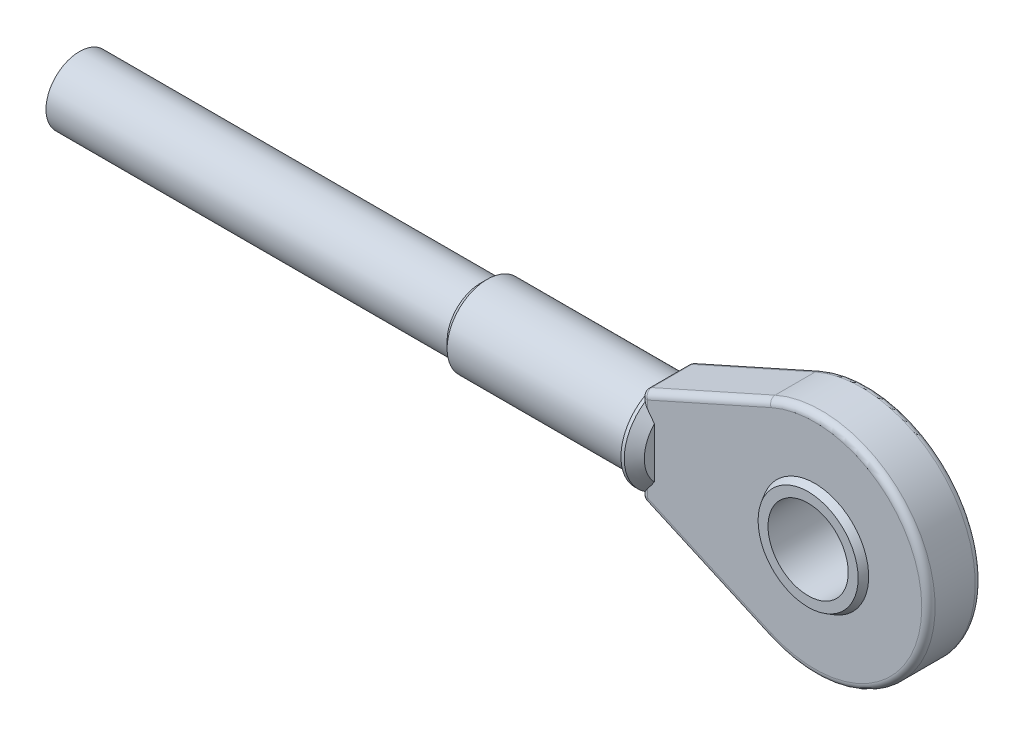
ISO-10303-21;
HEADER;
FILE_DESCRIPTION(('STEP AP214'),'2;1');
FILE_NAME('part.step','',(''),(''),'','','');
FILE_SCHEMA(('AUTOMOTIVE_DESIGN { 1 0 10303 214 1 1 1 1 }'));
ENDSEC;
DATA;
#1=APPLICATION_CONTEXT('core data for automotive mechanical design processes');
#2=APPLICATION_PROTOCOL_DEFINITION('international standard','automotive_design',2000,#1);
#3=PRODUCT_CONTEXT('',#1,'mechanical');
#4=PRODUCT('Part','Part','',(#3));
#5=PRODUCT_RELATED_PRODUCT_CATEGORY('part','',(#4));
#6=PRODUCT_DEFINITION_FORMATION('','',#4);
#7=PRODUCT_DEFINITION_CONTEXT('part definition',#1,'design');
#8=PRODUCT_DEFINITION('design','',#6,#7);
#9=PRODUCT_DEFINITION_SHAPE('','',#8);
#10=(LENGTH_UNIT() NAMED_UNIT(*) SI_UNIT(.MILLI.,.METRE.));
#11=(NAMED_UNIT(*) PLANE_ANGLE_UNIT() SI_UNIT($,.RADIAN.));
#12=(NAMED_UNIT(*) SI_UNIT($,.STERADIAN.) SOLID_ANGLE_UNIT());
#13=UNCERTAINTY_MEASURE_WITH_UNIT(LENGTH_MEASURE(1.E-05),#10,'distance_accuracy_value','');
#14=(GEOMETRIC_REPRESENTATION_CONTEXT(3) GLOBAL_UNCERTAINTY_ASSIGNED_CONTEXT((#13)) GLOBAL_UNIT_ASSIGNED_CONTEXT((#10,
#11,#12)) REPRESENTATION_CONTEXT('',''));
#15=CARTESIAN_POINT('',(0.,0.,0.));
#16=DIRECTION('',(0.,0.,1.));
#17=DIRECTION('',(1.,0.,0.));
#18=AXIS2_PLACEMENT_3D('',#15,#16,#17);
#19=CARTESIAN_POINT('',(54.,0.,0.));
#20=DIRECTION('',(-1.,0.,0.));
#21=DIRECTION('',(0.,1.,0.));
#22=AXIS2_PLACEMENT_3D('',#19,#20,#21);
#23=SPHERICAL_SURFACE('',#22,9.);
#24=CARTESIAN_POINT('',(54.,0.,0.));
#25=DIRECTION('',(0.,0.,-1.));
#26=DIRECTION('',(-1.,0.,0.));
#27=AXIS2_PLACEMENT_3D('',#24,#25,#26);
#28=SPHERICAL_SURFACE('',#27,9.);
#29=CARTESIAN_POINT('',(54.,0.,4.));
#30=DIRECTION('',(0.,0.,-1.));
#31=DIRECTION('',(-1.,0.,0.));
#32=AXIS2_PLACEMENT_3D('',#29,#30,#31);
#33=CIRCLE('',#32,8.06225774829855);
#34=CARTESIAN_POINT('',(45.9377422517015,0.,4.));
#35=VERTEX_POINT('',#34);
#36=EDGE_CURVE('E691',#35,#35,#33,.F.);
#37=ORIENTED_EDGE('',*,*,#36,.T.);
#38=EDGE_LOOP('',(#37));
#39=FACE_BOUND('',#38,.T.);
#40=CARTESIAN_POINT('',(54.,0.,5.));
#41=DIRECTION('',(0.,0.,1.));
#42=DIRECTION('',(1.,0.,0.));
#43=AXIS2_PLACEMENT_3D('',#40,#41,#42);
#44=CIRCLE('',#43,7.48331477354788);
#45=CARTESIAN_POINT('',(61.4833147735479,0.,5.));
#46=VERTEX_POINT('',#45);
#47=EDGE_CURVE('E516',#46,#46,#44,.T.);
#48=ORIENTED_EDGE('',*,*,#47,.F.);
#49=EDGE_LOOP('',(#48));
#50=FACE_BOUND('',#49,.T.);
#51=ADVANCED_FACE('F369',(#39,#50),#28,.T.);
#52=CARTESIAN_POINT('',(30.,0.,0.));
#53=DIRECTION('',(1.,0.,0.));
#54=DIRECTION('',(0.,0.,-1.));
#55=AXIS2_PLACEMENT_3D('',#52,#53,#54);
#56=PLANE('',#55);
#57=DIRECTION('',(0.,1.,0.));
#58=VECTOR('',#57,1.);
#59=CARTESIAN_POINT('',(30.,-4.,-4.));
#60=LINE('',#59,#58);
#61=CARTESIAN_POINT('',(30.,-3.77491721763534,-4.));
#62=VERTEX_POINT('',#61);
#63=CARTESIAN_POINT('',(30.,3.77491721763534,-4.));
#64=VERTEX_POINT('',#63);
#65=EDGE_CURVE('E500',#62,#64,#60,.T.);
#66=ORIENTED_EDGE('',*,*,#65,.F.);
#67=CARTESIAN_POINT('',(30.,0.,0.));
#68=DIRECTION('',(1.,0.,0.));
#69=DIRECTION('',(0.,0.,-1.));
#70=AXIS2_PLACEMENT_3D('',#67,#68,#69);
#71=CIRCLE('',#70,5.49999999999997);
#72=EDGE_CURVE('E511',#62,#64,#71,.T.);
#73=ORIENTED_EDGE('',*,*,#72,.T.);
#74=EDGE_LOOP('',(#66,#73));
#75=FACE_BOUND('',#74,.T.);
#76=ADVANCED_FACE('F510',(#75),#56,.T.);
#77=CARTESIAN_POINT('',(30.,0.,0.));
#78=DIRECTION('',(-1.,0.,0.));
#79=DIRECTION('',(0.,0.,1.));
#80=AXIS2_PLACEMENT_3D('',#77,#78,#79);
#81=CYLINDRICAL_SURFACE('',#80,7.);
#82=CARTESIAN_POINT('',(28.,0.,0.));
#83=DIRECTION('',(1.,0.,0.));
#84=DIRECTION('',(0.,0.,-1.));
#85=AXIS2_PLACEMENT_3D('',#82,#83,#84);
#86=CIRCLE('',#85,7.);
#87=CARTESIAN_POINT('',(28.,-6.32455532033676,-3.));
#88=VERTEX_POINT('',#87);
#89=CARTESIAN_POINT('',(28.,6.32455532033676,-3.));
#90=VERTEX_POINT('',#89);
#91=EDGE_CURVE('E512',#88,#90,#86,.T.);
#92=ORIENTED_EDGE('',*,*,#91,.T.);
#93=CARTESIAN_POINT('',(28.,6.32455532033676,-3.));
#94=CARTESIAN_POINT('',(27.9999990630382,6.29460979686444,-3.06322005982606));
#95=CARTESIAN_POINT('',(28.0059913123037,6.26367381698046,-3.12590551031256));
#96=CARTESIAN_POINT('',(28.029427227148,6.20079028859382,-3.24882066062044));
#97=CARTESIAN_POINT('',(28.0469047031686,6.16884001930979,-3.30904255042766));
#98=CARTESIAN_POINT('',(28.0927628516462,6.10509614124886,-3.42523477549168));
#99=CARTESIAN_POINT('',(28.1211403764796,6.07330248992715,-3.48120633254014));
#100=CARTESIAN_POINT('',(28.1882266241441,6.01122724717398,-3.58732541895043));
#101=CARTESIAN_POINT('',(28.2269083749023,5.98094194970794,-3.63748766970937));
#102=CARTESIAN_POINT('',(28.3033345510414,5.93049185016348,-3.71900087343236));
#103=CARTESIAN_POINT('',(28.3389578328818,5.90967302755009,-3.7519402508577));
#104=CARTESIAN_POINT('',(28.4155526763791,5.87052402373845,-3.81290988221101));
#105=CARTESIAN_POINT('',(28.4565378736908,5.8522004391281,-3.84092717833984));
#106=CARTESIAN_POINT('',(28.5,5.83556745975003,-3.86602540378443));
#107=B_SPLINE_CURVE_WITH_KNOTS('',3,(#93,#94,#95,#96,#97,#98,#99,#100,#101,#102,#103,#104,#105,
#106),.UNSPECIFIED.,.F.,.F.,(4,2,2,2,2,2,4),(0.,0.209520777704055,0.419661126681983,
0.629740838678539,0.839275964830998,0.997139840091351,1.15541327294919),.UNSPECIFIED.);
#108=CARTESIAN_POINT('',(28.5,5.83556745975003,-3.86602540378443));
#109=VERTEX_POINT('',#108);
#110=EDGE_CURVE('E603',#90,#109,#107,.T.);
#111=ORIENTED_EDGE('',*,*,#110,.T.);
#112=CARTESIAN_POINT('',(28.5,0.,0.));
#113=DIRECTION('',(1.,0.,0.));
#114=DIRECTION('',(0.,0.,-1.));
#115=AXIS2_PLACEMENT_3D('',#112,#113,#114);
#116=CIRCLE('',#115,7.);
#117=CARTESIAN_POINT('',(28.5,-5.83556745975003,-3.86602540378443));
#118=VERTEX_POINT('',#117);
#119=EDGE_CURVE('E392',#109,#118,#116,.F.);
#120=ORIENTED_EDGE('',*,*,#119,.T.);
#121=CARTESIAN_POINT('',(28.5,-5.83556745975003,-3.86602540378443));
#122=CARTESIAN_POINT('',(28.4478275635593,-5.85554295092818,-3.83589637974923));
#123=CARTESIAN_POINT('',(28.3992398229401,-5.87793426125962,-3.80157259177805));
#124=CARTESIAN_POINT('',(28.3099637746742,-5.92604152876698,-3.72612002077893));
#125=CARTESIAN_POINT('',(28.2692416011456,-5.95174240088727,-3.68502189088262));
#126=CARTESIAN_POINT('',(28.196084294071,-6.0050702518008,-3.59746608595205));
#127=CARTESIAN_POINT('',(28.1636210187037,-6.03269027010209,-3.5510274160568));
#128=CARTESIAN_POINT('',(28.1070833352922,-6.08891769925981,-3.45372955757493));
#129=CARTESIAN_POINT('',(28.0830226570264,-6.11752664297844,-3.40286330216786));
#130=CARTESIAN_POINT('',(28.0425669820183,-6.17648142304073,-3.29470150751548));
#131=CARTESIAN_POINT('',(28.0267134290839,-6.20682929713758,-3.23720349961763));
#132=CARTESIAN_POINT('',(28.0054364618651,-6.26660121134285,-3.11996025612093));
#133=CARTESIAN_POINT('',(27.9999981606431,-6.29602651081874,-3.06021835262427));
#134=CARTESIAN_POINT('',(28.,-6.32455532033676,-3.));
#135=B_SPLINE_CURVE_WITH_KNOTS('',3,(#121,#122,#123,#124,#125,#126,#127,#128,#129,#130,#131,
#132,#133,#134),.UNSPECIFIED.,.F.,.F.,(4,2,2,2,2,2,4),(0.,0.189856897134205,0.378877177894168,
0.567244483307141,0.755918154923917,0.95582068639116,1.15543727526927),.UNSPECIFIED.);
#136=EDGE_CURVE('E561',#118,#88,#135,.T.);
#137=ORIENTED_EDGE('',*,*,#136,.T.);
#138=EDGE_LOOP('',(#92,#111,#120,#137));
#139=FACE_BOUND('',#138,.T.);
#140=ADVANCED_FACE('F672',(#139),#81,.T.);
#141=CARTESIAN_POINT('',(54.,0.,0.));
#142=DIRECTION('',(0.,0.,1.));
#143=DIRECTION('',(1.,0.,0.));
#144=AXIS2_PLACEMENT_3D('',#141,#142,#143);
#145=SPHERICAL_SURFACE('',#144,9.);
#146=CARTESIAN_POINT('',(54.,0.,-5.));
#147=DIRECTION('',(0.,0.,1.));
#148=DIRECTION('',(1.,0.,0.));
#149=AXIS2_PLACEMENT_3D('',#146,#147,#148);
#150=CIRCLE('',#149,7.48331477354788);
#151=CARTESIAN_POINT('',(61.4833147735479,0.,-5.));
#152=VERTEX_POINT('',#151);
#153=EDGE_CURVE('E521',#152,#152,#150,.T.);
#154=ORIENTED_EDGE('',*,*,#153,.T.);
#155=EDGE_LOOP('',(#154));
#156=FACE_BOUND('',#155,.T.);
#157=CARTESIAN_POINT('',(54.,0.,-4.));
#158=DIRECTION('',(0.,0.,1.));
#159=DIRECTION('',(1.,0.,0.));
#160=AXIS2_PLACEMENT_3D('',#157,#158,#159);
#161=CIRCLE('',#160,8.06225774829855);
#162=CARTESIAN_POINT('',(62.0622577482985,0.,-4.));
#163=VERTEX_POINT('',#162);
#164=EDGE_CURVE('E690',#163,#163,#161,.F.);
#165=ORIENTED_EDGE('',*,*,#164,.T.);
#166=EDGE_LOOP('',(#165));
#167=FACE_BOUND('',#166,.T.);
#168=ADVANCED_FACE('F667',(#156,#167),#145,.T.);
#169=CARTESIAN_POINT('',(54.,4.,4.));
#170=DIRECTION('',(0.,0.,-1.));
#171=DIRECTION('',(-1.,0.,0.));
#172=AXIS2_PLACEMENT_3D('',#169,#170,#171);
#173=PLANE('',#172);
#174=CARTESIAN_POINT('',(30.,-3.77491721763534,4.));
#175=CARTESIAN_POINT('',(29.9415821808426,-3.86002294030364,4.));
#176=CARTESIAN_POINT('',(29.8824642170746,-3.94464346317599,4.));
#177=CARTESIAN_POINT('',(29.7629928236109,-4.11300171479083,4.));
#178=CARTESIAN_POINT('',(29.7026394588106,-4.19673948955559,4.));
#179=CARTESIAN_POINT('',(29.5200183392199,-4.44669923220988,4.));
#180=CARTESIAN_POINT('',(29.3961373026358,-4.61174316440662,4.));
#181=CARTESIAN_POINT('',(29.1450745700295,-4.93924639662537,4.));
#182=CARTESIAN_POINT('',(29.0178933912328,-5.1017060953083,4.));
#183=CARTESIAN_POINT('',(28.760810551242,-5.42457859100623,4.));
#184=CARTESIAN_POINT('',(28.6309077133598,-5.58499045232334,4.));
#185=CARTESIAN_POINT('',(28.5,-5.74456264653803,4.));
#186=B_SPLINE_CURVE_WITH_KNOTS('',3,(#174,#175,#176,#177,#178,#179,#180,#181,#182,#183,#184,
#185),.UNSPECIFIED.,.F.,.F.,(4,2,2,2,2,4),(0.,0.309668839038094,0.61932145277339,
1.23835119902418,1.85728450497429,2.47649116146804),.UNSPECIFIED.);
#187=CARTESIAN_POINT('',(30.,-3.77491721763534,4.));
#188=VERTEX_POINT('',#187);
#189=CARTESIAN_POINT('',(29.,-5.12347538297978,4.));
#190=VERTEX_POINT('',#189);
#191=EDGE_CURVE('E505',#188,#190,#186,.T.);
#192=ORIENTED_EDGE('',*,*,#191,.T.);
#193=DIRECTION('',(0.,-1.,0.));
#194=VECTOR('',#193,1.);
#195=CARTESIAN_POINT('',(29.,4.,4.));
#196=LINE('',#195,#194);
#197=CARTESIAN_POINT('',(29.,-6.35161365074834,4.));
#198=VERTEX_POINT('',#197);
#199=EDGE_CURVE('E752',#190,#198,#196,.T.);
#200=ORIENTED_EDGE('',*,*,#199,.T.);
#201=DIRECTION('',(0.91295991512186,-0.408049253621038,0.));
#202=VECTOR('',#201,1.);
#203=CARTESIAN_POINT('',(45.9810814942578,-13.941341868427,4.));
#204=LINE('',#203,#202);
#205=CARTESIAN_POINT('',(47.4712119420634,-14.6073586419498,4.));
#206=VERTEX_POINT('',#205);
#207=EDGE_CURVE('E750',#198,#206,#204,.T.);
#208=ORIENTED_EDGE('',*,*,#207,.T.);
#209=CARTESIAN_POINT('',(54.,0.,4.));
#210=DIRECTION('',(0.,0.,-1.));
#211=DIRECTION('',(-1.,0.,0.));
#212=AXIS2_PLACEMENT_3D('',#209,#210,#211);
#213=CIRCLE('',#212,16.);
#214=CARTESIAN_POINT('',(47.4712119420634,14.6073586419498,4.));
#215=VERTEX_POINT('',#214);
#216=EDGE_CURVE('E748',#206,#215,#213,.F.);
#217=ORIENTED_EDGE('',*,*,#216,.T.);
#218=DIRECTION('',(-0.91295991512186,-0.408049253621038,0.));
#219=VECTOR('',#218,1.);
#220=CARTESIAN_POINT('',(48.961342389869,15.2733754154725,4.));
#221=LINE('',#220,#219);
#222=CARTESIAN_POINT('',(29.,6.35161365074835,4.));
#223=VERTEX_POINT('',#222);
#224=EDGE_CURVE('E746',#215,#223,#221,.T.);
#225=ORIENTED_EDGE('',*,*,#224,.T.);
#226=DIRECTION('',(0.,-1.,0.));
#227=VECTOR('',#226,1.);
#228=CARTESIAN_POINT('',(29.,4.,4.));
#229=LINE('',#228,#227);
#230=CARTESIAN_POINT('',(28.9999999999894,5.12347538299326,4.));
#231=VERTEX_POINT('',#230);
#232=EDGE_CURVE('E744',#223,#231,#229,.T.);
#233=ORIENTED_EDGE('',*,*,#232,.T.);
#234=CARTESIAN_POINT('',(28.5,5.74456264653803,4.));
#235=CARTESIAN_POINT('',(28.6309077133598,5.58499045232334,4.));
#236=CARTESIAN_POINT('',(28.760810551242,5.42457859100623,4.));
#237=CARTESIAN_POINT('',(29.0178933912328,5.1017060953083,4.));
#238=CARTESIAN_POINT('',(29.1450745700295,4.93924639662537,4.));
#239=CARTESIAN_POINT('',(29.3961373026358,4.61174316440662,4.));
#240=CARTESIAN_POINT('',(29.5200183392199,4.44669923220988,4.));
#241=CARTESIAN_POINT('',(29.7026394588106,4.19673948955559,4.));
#242=CARTESIAN_POINT('',(29.7629928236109,4.11300171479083,4.));
#243=CARTESIAN_POINT('',(29.8824642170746,3.94464346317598,4.));
#244=CARTESIAN_POINT('',(29.9415821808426,3.86002294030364,4.));
#245=CARTESIAN_POINT('',(30.,3.77491721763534,4.));
#246=B_SPLINE_CURVE_WITH_KNOTS('',3,(#234,#235,#236,#237,#238,#239,#240,#241,#242,#243,#244,
#245),.UNSPECIFIED.,.F.,.F.,(4,2,2,2,2,4),(0.,0.619206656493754,1.23813996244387,
1.85716970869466,2.16682232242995,2.47649116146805),.UNSPECIFIED.);
#247=CARTESIAN_POINT('',(30.,3.77491721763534,4.));
#248=VERTEX_POINT('',#247);
#249=EDGE_CURVE('E833',#231,#248,#246,.T.);
#250=ORIENTED_EDGE('',*,*,#249,.T.);
#251=DIRECTION('',(0.,-1.,0.));
#252=VECTOR('',#251,1.);
#253=CARTESIAN_POINT('',(30.,4.,4.));
#254=LINE('',#253,#252);
#255=EDGE_CURVE('E513',#248,#188,#254,.T.);
#256=ORIENTED_EDGE('',*,*,#255,.T.);
#257=EDGE_LOOP('',(#192,#200,#208,#217,#225,#233,#250,#256));
#258=FACE_BOUND('',#257,.T.);
#259=ORIENTED_EDGE('',*,*,#36,.F.);
#260=EDGE_LOOP('',(#259));
#261=FACE_BOUND('',#260,.T.);
#262=ADVANCED_FACE('F677',(#258,#261),#173,.F.);
#263=CARTESIAN_POINT('',(54.,-4.,-4.));
#264=DIRECTION('',(0.,0.,1.));
#265=DIRECTION('',(1.,0.,0.));
#266=AXIS2_PLACEMENT_3D('',#263,#264,#265);
#267=PLANE('',#266);
#268=DIRECTION('',(0.91295991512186,-0.408049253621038,0.));
#269=VECTOR('',#268,1.);
#270=CARTESIAN_POINT('',(48.961342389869,-15.2733754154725,-4.));
#271=LINE('',#270,#269);
#272=CARTESIAN_POINT('',(47.4712119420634,-14.6073586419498,-4.));
#273=VERTEX_POINT('',#272);
#274=CARTESIAN_POINT('',(29.,-6.35161365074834,-4.));
#275=VERTEX_POINT('',#274);
#276=EDGE_CURVE('E741',#273,#275,#271,.F.);
#277=ORIENTED_EDGE('',*,*,#276,.T.);
#278=DIRECTION('',(0.,-1.,0.));
#279=VECTOR('',#278,1.);
#280=CARTESIAN_POINT('',(29.,-4.,-4.));
#281=LINE('',#280,#279);
#282=CARTESIAN_POINT('',(28.9999999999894,-5.12347538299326,-4.));
#283=VERTEX_POINT('',#282);
#284=EDGE_CURVE('E502',#275,#283,#281,.F.);
#285=ORIENTED_EDGE('',*,*,#284,.T.);
#286=CARTESIAN_POINT('',(28.5,-5.74456264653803,-4.));
#287=CARTESIAN_POINT('',(28.6309077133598,-5.58499045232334,-4.));
#288=CARTESIAN_POINT('',(28.760810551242,-5.42457859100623,-4.));
#289=CARTESIAN_POINT('',(29.0178933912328,-5.1017060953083,-4.));
#290=CARTESIAN_POINT('',(29.1450745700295,-4.93924639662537,-4.));
#291=CARTESIAN_POINT('',(29.3961373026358,-4.61174316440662,-4.));
#292=CARTESIAN_POINT('',(29.5200183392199,-4.44669923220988,-4.));
#293=CARTESIAN_POINT('',(29.7026394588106,-4.19673948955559,-4.));
#294=CARTESIAN_POINT('',(29.7629928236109,-4.11300171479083,-4.));
#295=CARTESIAN_POINT('',(29.8824642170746,-3.94464346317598,-4.));
#296=CARTESIAN_POINT('',(29.9415821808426,-3.86002294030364,-4.));
#297=CARTESIAN_POINT('',(30.,-3.77491721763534,-4.));
#298=B_SPLINE_CURVE_WITH_KNOTS('',3,(#286,#287,#288,#289,#290,#291,#292,#293,#294,#295,#296,
#297),.UNSPECIFIED.,.F.,.F.,(4,2,2,2,2,4),(0.,0.619206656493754,1.23813996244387,
1.85716970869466,2.16682232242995,2.47649116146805),.UNSPECIFIED.);
#299=EDGE_CURVE('E495',#283,#62,#298,.T.);
#300=ORIENTED_EDGE('',*,*,#299,.T.);
#301=ORIENTED_EDGE('',*,*,#65,.T.);
#302=CARTESIAN_POINT('',(30.,3.77491721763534,-4.));
#303=CARTESIAN_POINT('',(29.9415821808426,3.86002294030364,-4.));
#304=CARTESIAN_POINT('',(29.8824642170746,3.94464346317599,-4.));
#305=CARTESIAN_POINT('',(29.7629928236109,4.11300171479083,-4.));
#306=CARTESIAN_POINT('',(29.7026394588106,4.19673948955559,-4.));
#307=CARTESIAN_POINT('',(29.5200183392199,4.44669923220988,-4.));
#308=CARTESIAN_POINT('',(29.3961373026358,4.61174316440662,-4.));
#309=CARTESIAN_POINT('',(29.1450745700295,4.93924639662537,-4.));
#310=CARTESIAN_POINT('',(29.0178933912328,5.1017060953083,-4.));
#311=CARTESIAN_POINT('',(28.760810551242,5.42457859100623,-4.));
#312=CARTESIAN_POINT('',(28.6309077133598,5.58499045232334,-4.));
#313=CARTESIAN_POINT('',(28.5,5.74456264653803,-4.));
#314=B_SPLINE_CURVE_WITH_KNOTS('',3,(#302,#303,#304,#305,#306,#307,#308,#309,#310,#311,#312,
#313),.UNSPECIFIED.,.F.,.F.,(4,2,2,2,2,4),(0.,0.309668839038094,0.61932145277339,
1.23835119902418,1.85728450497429,2.47649116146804),.UNSPECIFIED.);
#315=CARTESIAN_POINT('',(29.,5.12347538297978,-4.));
#316=VERTEX_POINT('',#315);
#317=EDGE_CURVE('E506',#64,#316,#314,.T.);
#318=ORIENTED_EDGE('',*,*,#317,.T.);
#319=DIRECTION('',(0.,-1.,0.));
#320=VECTOR('',#319,1.);
#321=CARTESIAN_POINT('',(29.,-4.,-4.));
#322=LINE('',#321,#320);
#323=CARTESIAN_POINT('',(29.,6.35161365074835,-4.));
#324=VERTEX_POINT('',#323);
#325=EDGE_CURVE('E739',#316,#324,#322,.F.);
#326=ORIENTED_EDGE('',*,*,#325,.T.);
#327=DIRECTION('',(-0.91295991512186,-0.408049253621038,0.));
#328=VECTOR('',#327,1.);
#329=CARTESIAN_POINT('',(45.9810814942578,13.941341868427,-4.));
#330=LINE('',#329,#328);
#331=CARTESIAN_POINT('',(47.4712119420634,14.6073586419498,-4.));
#332=VERTEX_POINT('',#331);
#333=EDGE_CURVE('E734',#324,#332,#330,.F.);
#334=ORIENTED_EDGE('',*,*,#333,.T.);
#335=CARTESIAN_POINT('',(54.,0.,-4.));
#336=DIRECTION('',(0.,0.,1.));
#337=DIRECTION('',(1.,0.,0.));
#338=AXIS2_PLACEMENT_3D('',#335,#336,#337);
#339=CIRCLE('',#338,16.);
#340=EDGE_CURVE('E732',#332,#273,#339,.F.);
#341=ORIENTED_EDGE('',*,*,#340,.T.);
#342=EDGE_LOOP('',(#277,#285,#300,#301,#318,#326,#334,#341));
#343=FACE_BOUND('',#342,.T.);
#344=ORIENTED_EDGE('',*,*,#164,.F.);
#345=EDGE_LOOP('',(#344));
#346=FACE_BOUND('',#345,.T.);
#347=ADVANCED_FACE('F497',(#343,#346),#267,.F.);
#348=ORIENTED_EDGE('',*,*,#255,.F.);
#349=CARTESIAN_POINT('',(30.,0.,0.));
#350=DIRECTION('',(1.,0.,0.));
#351=DIRECTION('',(0.,0.,-1.));
#352=AXIS2_PLACEMENT_3D('',#349,#350,#351);
#353=CIRCLE('',#352,5.49999999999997);
#354=EDGE_CURVE('E518',#248,#188,#353,.T.);
#355=ORIENTED_EDGE('',*,*,#354,.T.);
#356=EDGE_LOOP('',(#348,#355));
#357=FACE_BOUND('',#356,.T.);
#358=ADVANCED_FACE('F673',(#357),#56,.T.);
#359=CARTESIAN_POINT('',(28.,0.,0.));
#360=DIRECTION('',(-1.,0.,0.));
#361=DIRECTION('',(0.,0.,1.));
#362=AXIS2_PLACEMENT_3D('',#359,#360,#361);
#363=CYLINDRICAL_SURFACE('',#362,6.);
#364=CARTESIAN_POINT('',(1.00000000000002,0.,0.));
#365=DIRECTION('',(1.,0.,0.));
#366=DIRECTION('',(0.,0.,-1.));
#367=AXIS2_PLACEMENT_3D('',#364,#365,#366);
#368=CIRCLE('',#367,6.);
#369=CARTESIAN_POINT('',(1.00000000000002,0.,-6.));
#370=VERTEX_POINT('',#369);
#371=EDGE_CURVE('E377',#370,#370,#368,.T.);
#372=ORIENTED_EDGE('',*,*,#371,.T.);
#373=EDGE_LOOP('',(#372));
#374=FACE_BOUND('',#373,.T.);
#375=CARTESIAN_POINT('',(28.,0.,0.));
#376=DIRECTION('',(1.,0.,0.));
#377=DIRECTION('',(0.,0.,-1.));
#378=AXIS2_PLACEMENT_3D('',#375,#376,#377);
#379=CIRCLE('',#378,6.);
#380=CARTESIAN_POINT('',(28.,0.,-6.));
#381=VERTEX_POINT('',#380);
#382=EDGE_CURVE('E704',#381,#381,#379,.T.);
#383=ORIENTED_EDGE('',*,*,#382,.F.);
#384=EDGE_LOOP('',(#383));
#385=FACE_BOUND('',#384,.T.);
#386=ADVANCED_FACE('F371',(#374,#385),#363,.T.);
#387=CARTESIAN_POINT('',(28.,0.,0.));
#388=DIRECTION('',(1.,0.,0.));
#389=DIRECTION('',(0.,0.,-1.));
#390=AXIS2_PLACEMENT_3D('',#387,#388,#389);
#391=PLANE('',#390);
#392=ORIENTED_EDGE('',*,*,#382,.T.);
#393=EDGE_LOOP('',(#392));
#394=FACE_BOUND('',#393,.T.);
#395=ORIENTED_EDGE('',*,*,#91,.F.);
#396=DIRECTION('',(0.,-1.,0.));
#397=VECTOR('',#396,1.);
#398=CARTESIAN_POINT('',(28.,0.,-3.));
#399=LINE('',#398,#397);
#400=CARTESIAN_POINT('',(28.,-6.35161365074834,-3.));
#401=VERTEX_POINT('',#400);
#402=EDGE_CURVE('E729',#88,#401,#399,.T.);
#403=ORIENTED_EDGE('',*,*,#402,.T.);
#404=DIRECTION('',(0.,0.,-1.));
#405=VECTOR('',#404,1.);
#406=CARTESIAN_POINT('',(28.,-6.35161365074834,0.));
#407=LINE('',#406,#405);
#408=CARTESIAN_POINT('',(28.,-6.35161365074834,3.));
#409=VERTEX_POINT('',#408);
#410=EDGE_CURVE('E719',#401,#409,#407,.F.);
#411=ORIENTED_EDGE('',*,*,#410,.T.);
#412=DIRECTION('',(0.,-1.,0.));
#413=VECTOR('',#412,1.);
#414=CARTESIAN_POINT('',(28.,0.,3.));
#415=LINE('',#414,#413);
#416=CARTESIAN_POINT('',(28.,-6.32455532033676,3.));
#417=VERTEX_POINT('',#416);
#418=EDGE_CURVE('E716',#409,#417,#415,.F.);
#419=ORIENTED_EDGE('',*,*,#418,.T.);
#420=CARTESIAN_POINT('',(28.,6.32455532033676,3.));
#421=VERTEX_POINT('',#420);
#422=EDGE_CURVE('E703',#421,#417,#86,.T.);
#423=ORIENTED_EDGE('',*,*,#422,.F.);
#424=DIRECTION('',(0.,-1.,0.));
#425=VECTOR('',#424,1.);
#426=CARTESIAN_POINT('',(28.,0.,3.));
#427=LINE('',#426,#425);
#428=CARTESIAN_POINT('',(28.,6.35161365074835,3.));
#429=VERTEX_POINT('',#428);
#430=EDGE_CURVE('E843',#421,#429,#427,.F.);
#431=ORIENTED_EDGE('',*,*,#430,.T.);
#432=DIRECTION('',(0.,0.,-1.));
#433=VECTOR('',#432,1.);
#434=CARTESIAN_POINT('',(28.,6.35161365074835,0.));
#435=LINE('',#434,#433);
#436=CARTESIAN_POINT('',(28.,6.35161365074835,-3.));
#437=VERTEX_POINT('',#436);
#438=EDGE_CURVE('E845',#429,#437,#435,.T.);
#439=ORIENTED_EDGE('',*,*,#438,.T.);
#440=DIRECTION('',(0.,-1.,0.));
#441=VECTOR('',#440,1.);
#442=CARTESIAN_POINT('',(28.,0.,-3.));
#443=LINE('',#442,#441);
#444=EDGE_CURVE('E721',#437,#90,#443,.T.);
#445=ORIENTED_EDGE('',*,*,#444,.T.);
#446=EDGE_LOOP('',(#395,#403,#411,#419,#423,#431,#439,#445));
#447=FACE_BOUND('',#446,.T.);
#448=ADVANCED_FACE('F717',(#394,#447),#391,.F.);
#449=ORIENTED_EDGE('',*,*,#422,.T.);
#450=CARTESIAN_POINT('',(28.,-6.32455532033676,3.));
#451=CARTESIAN_POINT('',(27.9999990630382,-6.29460979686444,3.06322005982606));
#452=CARTESIAN_POINT('',(28.0059913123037,-6.26367381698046,3.12590551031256));
#453=CARTESIAN_POINT('',(28.029427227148,-6.20079028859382,3.24882066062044));
#454=CARTESIAN_POINT('',(28.0469047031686,-6.16884001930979,3.30904255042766));
#455=CARTESIAN_POINT('',(28.0927628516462,-6.10509614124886,3.42523477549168));
#456=CARTESIAN_POINT('',(28.1211403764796,-6.07330248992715,3.48120633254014));
#457=CARTESIAN_POINT('',(28.1882266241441,-6.01122724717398,3.58732541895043));
#458=CARTESIAN_POINT('',(28.2269083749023,-5.98094194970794,3.63748766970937));
#459=CARTESIAN_POINT('',(28.3033345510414,-5.93049185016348,3.71900087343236));
#460=CARTESIAN_POINT('',(28.3389578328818,-5.90967302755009,3.7519402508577));
#461=CARTESIAN_POINT('',(28.4155526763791,-5.87052402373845,3.81290988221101));
#462=CARTESIAN_POINT('',(28.4565378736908,-5.8522004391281,3.84092717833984));
#463=CARTESIAN_POINT('',(28.5,-5.83556745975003,3.86602540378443));
#464=B_SPLINE_CURVE_WITH_KNOTS('',3,(#450,#451,#452,#453,#454,#455,#456,#457,#458,#459,#460,
#461,#462,#463),.UNSPECIFIED.,.F.,.F.,(4,2,2,2,2,2,4),(0.,0.209520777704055,0.419661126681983,
0.629740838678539,0.839275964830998,0.997139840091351,1.15541327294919),.UNSPECIFIED.);
#465=CARTESIAN_POINT('',(28.5,-5.83556745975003,3.86602540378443));
#466=VERTEX_POINT('',#465);
#467=EDGE_CURVE('E593',#417,#466,#464,.T.);
#468=ORIENTED_EDGE('',*,*,#467,.T.);
#469=CARTESIAN_POINT('',(28.5,0.,0.));
#470=DIRECTION('',(1.,0.,0.));
#471=DIRECTION('',(0.,0.,-1.));
#472=AXIS2_PLACEMENT_3D('',#469,#470,#471);
#473=CIRCLE('',#472,7.);
#474=CARTESIAN_POINT('',(28.5,5.83556745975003,3.86602540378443));
#475=VERTEX_POINT('',#474);
#476=EDGE_CURVE('E384',#466,#475,#473,.F.);
#477=ORIENTED_EDGE('',*,*,#476,.T.);
#478=CARTESIAN_POINT('',(28.5,5.83556745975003,3.86602540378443));
#479=CARTESIAN_POINT('',(28.4478275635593,5.85554295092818,3.83589637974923));
#480=CARTESIAN_POINT('',(28.3992398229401,5.87793426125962,3.80157259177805));
#481=CARTESIAN_POINT('',(28.3099637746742,5.92604152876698,3.72612002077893));
#482=CARTESIAN_POINT('',(28.2692416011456,5.95174240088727,3.68502189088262));
#483=CARTESIAN_POINT('',(28.196084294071,6.0050702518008,3.59746608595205));
#484=CARTESIAN_POINT('',(28.1636210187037,6.03269027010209,3.5510274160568));
#485=CARTESIAN_POINT('',(28.1070833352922,6.08891769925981,3.45372955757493));
#486=CARTESIAN_POINT('',(28.0830226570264,6.11752664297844,3.40286330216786));
#487=CARTESIAN_POINT('',(28.0425669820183,6.17648142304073,3.29470150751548));
#488=CARTESIAN_POINT('',(28.0267134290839,6.20682929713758,3.23720349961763));
#489=CARTESIAN_POINT('',(28.0054364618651,6.26660121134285,3.11996025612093));
#490=CARTESIAN_POINT('',(27.9999981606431,6.29602651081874,3.06021835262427));
#491=CARTESIAN_POINT('',(28.,6.32455532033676,3.));
#492=B_SPLINE_CURVE_WITH_KNOTS('',3,(#478,#479,#480,#481,#482,#483,#484,#485,#486,#487,#488,
#489,#490,#491),.UNSPECIFIED.,.F.,.F.,(4,2,2,2,2,2,4),(0.,0.189856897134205,0.378877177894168,
0.567244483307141,0.755918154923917,0.95582068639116,1.15543727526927),.UNSPECIFIED.);
#493=EDGE_CURVE('E638',#475,#421,#492,.T.);
#494=ORIENTED_EDGE('',*,*,#493,.T.);
#495=EDGE_LOOP('',(#449,#468,#477,#494));
#496=FACE_BOUND('',#495,.T.);
#497=ADVANCED_FACE('F613',(#496),#81,.T.);
#498=CARTESIAN_POINT('',(28.,-7.,4.));
#499=DIRECTION('',(0.408049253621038,0.91295991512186,0.));
#500=DIRECTION('',(-0.91295991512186,0.408049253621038,0.));
#501=AXIS2_PLACEMENT_3D('',#498,#499,#500);
#502=PLANE('',#501);
#503=DIRECTION('',(0.,0.,-1.));
#504=VECTOR('',#503,1.);
#505=CARTESIAN_POINT('',(28.591950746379,-7.26457356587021,4.));
#506=LINE('',#505,#504);
#507=CARTESIAN_POINT('',(28.591950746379,-7.26457356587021,3.));
#508=VERTEX_POINT('',#507);
#509=CARTESIAN_POINT('',(28.591950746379,-7.26457356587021,-3.));
#510=VERTEX_POINT('',#509);
#511=EDGE_CURVE('E832',#508,#510,#506,.T.);
#512=ORIENTED_EDGE('',*,*,#511,.T.);
#513=DIRECTION('',(0.91295991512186,-0.408049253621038,0.));
#514=VECTOR('',#513,1.);
#515=CARTESIAN_POINT('',(28.,-7.,-3.));
#516=LINE('',#515,#514);
#517=CARTESIAN_POINT('',(47.0631626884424,-15.5203185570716,-3.));
#518=VERTEX_POINT('',#517);
#519=EDGE_CURVE('E835',#510,#518,#516,.T.);
#520=ORIENTED_EDGE('',*,*,#519,.T.);
#521=DIRECTION('',(0.,0.,-1.));
#522=VECTOR('',#521,1.);
#523=CARTESIAN_POINT('',(47.0631626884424,-15.5203185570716,4.));
#524=LINE('',#523,#522);
#525=CARTESIAN_POINT('',(47.0631626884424,-15.5203185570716,3.));
#526=VERTEX_POINT('',#525);
#527=EDGE_CURVE('E692',#526,#518,#524,.T.);
#528=ORIENTED_EDGE('',*,*,#527,.F.);
#529=DIRECTION('',(0.91295991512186,-0.408049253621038,0.));
#530=VECTOR('',#529,1.);
#531=CARTESIAN_POINT('',(28.,-7.,3.));
#532=LINE('',#531,#530);
#533=EDGE_CURVE('E826',#526,#508,#532,.F.);
#534=ORIENTED_EDGE('',*,*,#533,.T.);
#535=EDGE_LOOP('',(#512,#520,#528,#534));
#536=FACE_BOUND('',#535,.T.);
#537=ADVANCED_FACE('F912',(#536),#502,.F.);
#538=CARTESIAN_POINT('',(54.,0.,4.));
#539=DIRECTION('',(0.,0.,-1.));
#540=DIRECTION('',(-1.,0.,0.));
#541=AXIS2_PLACEMENT_3D('',#538,#539,#540);
#542=CYLINDRICAL_SURFACE('',#541,17.);
#543=ORIENTED_EDGE('',*,*,#527,.T.);
#544=CARTESIAN_POINT('',(54.,0.,-3.));
#545=DIRECTION('',(0.,0.,1.));
#546=DIRECTION('',(1.,0.,0.));
#547=AXIS2_PLACEMENT_3D('',#544,#545,#546);
#548=CIRCLE('',#547,17.);
#549=CARTESIAN_POINT('',(47.0631626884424,15.5203185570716,-3.));
#550=VERTEX_POINT('',#549);
#551=EDGE_CURVE('E562',#518,#550,#548,.T.);
#552=ORIENTED_EDGE('',*,*,#551,.T.);
#553=DIRECTION('',(0.,0.,-1.));
#554=VECTOR('',#553,1.);
#555=CARTESIAN_POINT('',(47.0631626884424,15.5203185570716,4.));
#556=LINE('',#555,#554);
#557=CARTESIAN_POINT('',(47.0631626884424,15.5203185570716,3.));
#558=VERTEX_POINT('',#557);
#559=EDGE_CURVE('E696',#558,#550,#556,.T.);
#560=ORIENTED_EDGE('',*,*,#559,.F.);
#561=CARTESIAN_POINT('',(54.,0.,3.));
#562=DIRECTION('',(0.,0.,-1.));
#563=DIRECTION('',(-1.,0.,0.));
#564=AXIS2_PLACEMENT_3D('',#561,#562,#563);
#565=CIRCLE('',#564,17.);
#566=EDGE_CURVE('E759',#558,#526,#565,.T.);
#567=ORIENTED_EDGE('',*,*,#566,.T.);
#568=EDGE_LOOP('',(#543,#552,#560,#567));
#569=FACE_BOUND('',#568,.T.);
#570=ADVANCED_FACE('F766',(#569),#542,.T.);
#571=CARTESIAN_POINT('',(47.0631626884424,15.5203185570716,4.));
#572=DIRECTION('',(0.408049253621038,-0.91295991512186,0.));
#573=DIRECTION('',(0.91295991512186,0.408049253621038,0.));
#574=AXIS2_PLACEMENT_3D('',#571,#572,#573);
#575=PLANE('',#574);
#576=ORIENTED_EDGE('',*,*,#559,.T.);
#577=DIRECTION('',(-0.91295991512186,-0.408049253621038,0.));
#578=VECTOR('',#577,1.);
#579=CARTESIAN_POINT('',(47.0631626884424,15.5203185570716,-3.));
#580=LINE('',#579,#578);
#581=CARTESIAN_POINT('',(28.591950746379,7.26457356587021,-3.));
#582=VERTEX_POINT('',#581);
#583=EDGE_CURVE('E758',#550,#582,#580,.T.);
#584=ORIENTED_EDGE('',*,*,#583,.T.);
#585=DIRECTION('',(0.,0.,-1.));
#586=VECTOR('',#585,1.);
#587=CARTESIAN_POINT('',(28.591950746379,7.26457356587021,4.));
#588=LINE('',#587,#586);
#589=CARTESIAN_POINT('',(28.591950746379,7.26457356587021,3.));
#590=VERTEX_POINT('',#589);
#591=EDGE_CURVE('E756',#582,#590,#588,.F.);
#592=ORIENTED_EDGE('',*,*,#591,.T.);
#593=DIRECTION('',(-0.91295991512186,-0.408049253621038,0.));
#594=VECTOR('',#593,1.);
#595=CARTESIAN_POINT('',(47.0631626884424,15.5203185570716,3.));
#596=LINE('',#595,#594);
#597=EDGE_CURVE('E754',#590,#558,#596,.F.);
#598=ORIENTED_EDGE('',*,*,#597,.T.);
#599=EDGE_LOOP('',(#576,#584,#592,#598));
#600=FACE_BOUND('',#599,.T.);
#601=ADVANCED_FACE('F774',(#600),#575,.F.);
#602=CARTESIAN_POINT('',(46.5166852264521,-8.,-5.));
#603=DIRECTION('',(0.,0.,1.));
#604=DIRECTION('',(1.,0.,0.));
#605=AXIS2_PLACEMENT_3D('',#602,#603,#604);
#606=PLANE('',#605);
#607=CARTESIAN_POINT('',(54.,0.,-5.));
#608=DIRECTION('',(0.,0.,1.));
#609=DIRECTION('',(1.,0.,0.));
#610=AXIS2_PLACEMENT_3D('',#607,#608,#609);
#611=CIRCLE('',#610,5.99999999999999);
#612=CARTESIAN_POINT('',(60.,0.,-5.));
#613=VERTEX_POINT('',#612);
#614=EDGE_CURVE('E1058',#613,#613,#611,.T.);
#615=ORIENTED_EDGE('',*,*,#614,.T.);
#616=EDGE_LOOP('',(#615));
#617=FACE_BOUND('',#616,.T.);
#618=ORIENTED_EDGE('',*,*,#153,.F.);
#619=EDGE_LOOP('',(#618));
#620=FACE_BOUND('',#619,.T.);
#621=ADVANCED_FACE('F927',(#617,#620),#606,.F.);
#622=CARTESIAN_POINT('',(46.5166852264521,-8.,5.));
#623=DIRECTION('',(0.,0.,1.));
#624=DIRECTION('',(1.,0.,0.));
#625=AXIS2_PLACEMENT_3D('',#622,#623,#624);
#626=PLANE('',#625);
#627=CARTESIAN_POINT('',(54.,0.,5.));
#628=DIRECTION('',(0.,0.,1.));
#629=DIRECTION('',(1.,0.,0.));
#630=AXIS2_PLACEMENT_3D('',#627,#628,#629);
#631=CIRCLE('',#630,5.99999999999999);
#632=CARTESIAN_POINT('',(60.,0.,5.));
#633=VERTEX_POINT('',#632);
#634=EDGE_CURVE('E1055',#633,#633,#631,.T.);
#635=ORIENTED_EDGE('',*,*,#634,.F.);
#636=EDGE_LOOP('',(#635));
#637=FACE_BOUND('',#636,.T.);
#638=ORIENTED_EDGE('',*,*,#47,.T.);
#639=EDGE_LOOP('',(#638));
#640=FACE_BOUND('',#639,.T.);
#641=ADVANCED_FACE('F545',(#637,#640),#626,.T.);
#642=CARTESIAN_POINT('',(30.,0.,0.));
#643=DIRECTION('',(-1.,0.,0.));
#644=DIRECTION('',(0.,0.,1.));
#645=AXIS2_PLACEMENT_3D('',#642,#643,#644);
#646=CONICAL_SURFACE('',#645,5.49999999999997,0.785398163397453);
#647=ORIENTED_EDGE('',*,*,#299,.F.);
#648=CARTESIAN_POINT('',(29.,-5.12347538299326,-4.));
#649=CARTESIAN_POINT('',(28.9771256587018,-5.15249879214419,-3.99999612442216));
#650=CARTESIAN_POINT('',(28.9545052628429,-5.18171237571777,-3.99921531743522));
#651=CARTESIAN_POINT('',(28.9097643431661,-5.24043556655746,-3.99617368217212));
#652=CARTESIAN_POINT('',(28.8876437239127,-5.26994511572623,-3.99391313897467));
#653=CARTESIAN_POINT('',(28.8222752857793,-5.35844419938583,-3.98505856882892));
#654=CARTESIAN_POINT('',(28.7797402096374,-5.41776268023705,-3.97638963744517));
#655=CARTESIAN_POINT('',(28.6965973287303,-5.53673139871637,-3.95383771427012));
#656=CARTESIAN_POINT('',(28.6559893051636,-5.59638159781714,-3.93995531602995));
#657=CARTESIAN_POINT('',(28.5765550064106,-5.71596191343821,-3.90693709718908));
#658=CARTESIAN_POINT('',(28.5377409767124,-5.77589154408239,-3.88777004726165));
#659=CARTESIAN_POINT('',(28.5,-5.83556745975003,-3.86602540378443));
#660=B_SPLINE_CURVE_WITH_KNOTS('',3,(#648,#649,#650,#651,#652,#653,#654,#655,#656,#657,#658,
#659),.UNSPECIFIED.,.F.,.F.,(4,2,2,2,2,4),(0.,0.110839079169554,0.221656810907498,
0.441930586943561,0.662179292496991,0.883758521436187),.UNSPECIFIED.);
#661=EDGE_CURVE('E554',#283,#118,#660,.T.);
#662=ORIENTED_EDGE('',*,*,#661,.T.);
#663=ORIENTED_EDGE('',*,*,#119,.F.);
#664=CARTESIAN_POINT('',(28.5,5.83556745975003,-3.86602540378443));
#665=CARTESIAN_POINT('',(28.5377409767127,5.77589154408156,-3.88777004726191));
#666=CARTESIAN_POINT('',(28.5765550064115,5.71596191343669,-3.90693709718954));
#667=CARTESIAN_POINT('',(28.6559893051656,5.59638159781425,-3.9399553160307));
#668=CARTESIAN_POINT('',(28.696597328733,5.53673139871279,-3.95383771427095));
#669=CARTESIAN_POINT('',(28.7797402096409,5.41776268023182,-3.97638963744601));
#670=CARTESIAN_POINT('',(28.8222752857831,5.35844419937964,-3.98505856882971));
#671=CARTESIAN_POINT('',(28.8876437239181,5.26994511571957,-3.99391313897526));
#672=CARTESIAN_POINT('',(28.9097643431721,5.24043556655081,-3.99617368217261));
#673=CARTESIAN_POINT('',(28.9545052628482,5.18171237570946,-3.9992153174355));
#674=CARTESIAN_POINT('',(28.9771256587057,5.15249879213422,-3.99999612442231));
#675=CARTESIAN_POINT('',(29.,5.12347538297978,-4.));
#676=B_SPLINE_CURVE_WITH_KNOTS('',3,(#664,#665,#666,#667,#668,#669,#670,#671,#672,#673,#674,
#675),.UNSPECIFIED.,.F.,.F.,(4,2,2,2,2,4),(0.,0.221579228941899,0.441827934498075,
0.66210171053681,0.772919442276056,0.883758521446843),.UNSPECIFIED.);
#677=EDGE_CURVE('E608',#109,#316,#676,.T.);
#678=ORIENTED_EDGE('',*,*,#677,.T.);
#679=ORIENTED_EDGE('',*,*,#317,.F.);
#680=ORIENTED_EDGE('',*,*,#72,.F.);
#681=EDGE_LOOP('',(#647,#662,#663,#678,#679,#680));
#682=FACE_BOUND('',#681,.T.);
#683=ADVANCED_FACE('F515',(#682),#646,.T.);
#684=CARTESIAN_POINT('',(30.,0.,0.));
#685=DIRECTION('',(-1.,0.,0.));
#686=DIRECTION('',(0.,0.,1.));
#687=AXIS2_PLACEMENT_3D('',#684,#685,#686);
#688=CONICAL_SURFACE('',#687,5.49999999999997,0.785398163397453);
#689=ORIENTED_EDGE('',*,*,#249,.F.);
#690=CARTESIAN_POINT('',(29.,5.12347538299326,4.));
#691=CARTESIAN_POINT('',(28.9771256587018,5.15249879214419,3.99999612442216));
#692=CARTESIAN_POINT('',(28.9545052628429,5.18171237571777,3.99921531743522));
#693=CARTESIAN_POINT('',(28.9097643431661,5.24043556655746,3.99617368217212));
#694=CARTESIAN_POINT('',(28.8876437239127,5.26994511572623,3.99391313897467));
#695=CARTESIAN_POINT('',(28.8222752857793,5.35844419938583,3.98505856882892));
#696=CARTESIAN_POINT('',(28.7797402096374,5.41776268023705,3.97638963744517));
#697=CARTESIAN_POINT('',(28.6965973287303,5.53673139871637,3.95383771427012));
#698=CARTESIAN_POINT('',(28.6559893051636,5.59638159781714,3.93995531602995));
#699=CARTESIAN_POINT('',(28.5765550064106,5.71596191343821,3.90693709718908));
#700=CARTESIAN_POINT('',(28.5377409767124,5.77589154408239,3.88777004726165));
#701=CARTESIAN_POINT('',(28.5,5.83556745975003,3.86602540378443));
#702=B_SPLINE_CURVE_WITH_KNOTS('',3,(#690,#691,#692,#693,#694,#695,#696,#697,#698,#699,#700,
#701),.UNSPECIFIED.,.F.,.F.,(4,2,2,2,2,4),(0.,0.110839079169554,0.221656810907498,
0.441930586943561,0.662179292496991,0.883758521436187),.UNSPECIFIED.);
#703=EDGE_CURVE('E633',#231,#475,#702,.T.);
#704=ORIENTED_EDGE('',*,*,#703,.T.);
#705=ORIENTED_EDGE('',*,*,#476,.F.);
#706=CARTESIAN_POINT('',(28.5,-5.83556745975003,3.86602540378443));
#707=CARTESIAN_POINT('',(28.5377409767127,-5.77589154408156,3.88777004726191));
#708=CARTESIAN_POINT('',(28.5765550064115,-5.71596191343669,3.90693709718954));
#709=CARTESIAN_POINT('',(28.6559893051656,-5.59638159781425,3.9399553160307));
#710=CARTESIAN_POINT('',(28.696597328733,-5.53673139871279,3.95383771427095));
#711=CARTESIAN_POINT('',(28.7797402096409,-5.41776268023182,3.97638963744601));
#712=CARTESIAN_POINT('',(28.8222752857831,-5.35844419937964,3.98505856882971));
#713=CARTESIAN_POINT('',(28.8876437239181,-5.26994511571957,3.99391313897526));
#714=CARTESIAN_POINT('',(28.9097643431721,-5.24043556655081,3.99617368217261));
#715=CARTESIAN_POINT('',(28.9545052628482,-5.18171237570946,3.9992153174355));
#716=CARTESIAN_POINT('',(28.9771256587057,-5.15249879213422,3.99999612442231));
#717=CARTESIAN_POINT('',(29.,-5.12347538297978,4.));
#718=B_SPLINE_CURVE_WITH_KNOTS('',3,(#706,#707,#708,#709,#710,#711,#712,#713,#714,#715,#716,
#717),.UNSPECIFIED.,.F.,.F.,(4,2,2,2,2,4),(0.,0.221579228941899,0.441827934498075,
0.66210171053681,0.772919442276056,0.883758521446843),.UNSPECIFIED.);
#719=EDGE_CURVE('E598',#466,#190,#718,.T.);
#720=ORIENTED_EDGE('',*,*,#719,.T.);
#721=ORIENTED_EDGE('',*,*,#191,.F.);
#722=ORIENTED_EDGE('',*,*,#354,.F.);
#723=EDGE_LOOP('',(#689,#704,#705,#720,#721,#722));
#724=FACE_BOUND('',#723,.T.);
#725=ADVANCED_FACE('F544',(#724),#688,.T.);
#726=CARTESIAN_POINT('',(29.,4.,3.));
#727=DIRECTION('',(0.,-1.,0.));
#728=DIRECTION('',(0.,0.,-1.));
#729=AXIS2_PLACEMENT_3D('',#726,#727,#728);
#730=CYLINDRICAL_SURFACE('',#729,1.);
#731=ORIENTED_EDGE('',*,*,#703,.F.);
#732=ORIENTED_EDGE('',*,*,#232,.F.);
#733=CARTESIAN_POINT('',(29.,6.35161365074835,3.));
#734=DIRECTION('',(0.,1.,0.));
#735=DIRECTION('',(0.,0.,1.));
#736=AXIS2_PLACEMENT_3D('',#733,#734,#735);
#737=CIRCLE('',#736,1.);
#738=EDGE_CURVE('E777',#429,#223,#737,.T.);
#739=ORIENTED_EDGE('',*,*,#738,.F.);
#740=ORIENTED_EDGE('',*,*,#430,.F.);
#741=ORIENTED_EDGE('',*,*,#493,.F.);
#742=EDGE_LOOP('',(#731,#732,#739,#740,#741));
#743=FACE_BOUND('',#742,.T.);
#744=ADVANCED_FACE('F627',(#743),#730,.T.);
#745=CARTESIAN_POINT('',(29.,6.35161365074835,0.));
#746=DIRECTION('',(0.,0.,-1.));
#747=DIRECTION('',(-1.,0.,0.));
#748=AXIS2_PLACEMENT_3D('',#745,#746,#747);
#749=CYLINDRICAL_SURFACE('',#748,1.);
#750=CARTESIAN_POINT('',(29.,6.35161365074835,-3.));
#751=DIRECTION('',(0.,0.,-1.));
#752=DIRECTION('',(-1.,0.,0.));
#753=AXIS2_PLACEMENT_3D('',#750,#751,#752);
#754=CIRCLE('',#753,1.);
#755=EDGE_CURVE('E804',#437,#582,#754,.T.);
#756=ORIENTED_EDGE('',*,*,#755,.F.);
#757=ORIENTED_EDGE('',*,*,#438,.F.);
#758=CARTESIAN_POINT('',(29.,6.35161365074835,3.));
#759=DIRECTION('',(0.,0.,1.));
#760=DIRECTION('',(1.,0.,0.));
#761=AXIS2_PLACEMENT_3D('',#758,#759,#760);
#762=CIRCLE('',#761,1.);
#763=EDGE_CURVE('E807',#590,#429,#762,.T.);
#764=ORIENTED_EDGE('',*,*,#763,.F.);
#765=ORIENTED_EDGE('',*,*,#591,.F.);
#766=EDGE_LOOP('',(#756,#757,#764,#765));
#767=FACE_BOUND('',#766,.T.);
#768=ADVANCED_FACE('F622',(#767),#749,.T.);
#769=CARTESIAN_POINT('',(29.,0.,-3.));
#770=DIRECTION('',(0.,-1.,0.));
#771=DIRECTION('',(0.,0.,-1.));
#772=AXIS2_PLACEMENT_3D('',#769,#770,#771);
#773=CYLINDRICAL_SURFACE('',#772,1.);
#774=ORIENTED_EDGE('',*,*,#110,.F.);
#775=ORIENTED_EDGE('',*,*,#444,.F.);
#776=CARTESIAN_POINT('',(29.,6.35161365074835,-3.));
#777=DIRECTION('',(0.,1.,0.));
#778=DIRECTION('',(0.,0.,1.));
#779=AXIS2_PLACEMENT_3D('',#776,#777,#778);
#780=CIRCLE('',#779,1.);
#781=EDGE_CURVE('E801',#324,#437,#780,.T.);
#782=ORIENTED_EDGE('',*,*,#781,.F.);
#783=ORIENTED_EDGE('',*,*,#325,.F.);
#784=ORIENTED_EDGE('',*,*,#677,.F.);
#785=EDGE_LOOP('',(#774,#775,#782,#783,#784));
#786=FACE_BOUND('',#785,.T.);
#787=ADVANCED_FACE('F616',(#786),#773,.T.);
#788=CARTESIAN_POINT('',(29.,6.35161365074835,3.));
#789=DIRECTION('',(0.,0.,1.));
#790=DIRECTION('',(1.,0.,0.));
#791=AXIS2_PLACEMENT_3D('',#788,#789,#790);
#792=SPHERICAL_SURFACE('',#791,1.);
#793=ORIENTED_EDGE('',*,*,#763,.T.);
#794=ORIENTED_EDGE('',*,*,#738,.T.);
#795=CARTESIAN_POINT('',(29.,6.35161365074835,3.));
#796=DIRECTION('',(-0.91295991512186,-0.408049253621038,0.));
#797=DIRECTION('',(0.408049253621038,-0.91295991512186,0.));
#798=AXIS2_PLACEMENT_3D('',#795,#796,#797);
#799=CIRCLE('',#798,1.);
#800=EDGE_CURVE('E798',#590,#223,#799,.F.);
#801=ORIENTED_EDGE('',*,*,#800,.F.);
#802=EDGE_LOOP('',(#793,#794,#801));
#803=FACE_BOUND('',#802,.T.);
#804=ADVANCED_FACE('F621',(#803),#792,.T.);
#805=CARTESIAN_POINT('',(29.,6.35161365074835,-3.));
#806=DIRECTION('',(0.,0.,1.));
#807=DIRECTION('',(1.,0.,0.));
#808=AXIS2_PLACEMENT_3D('',#805,#806,#807);
#809=SPHERICAL_SURFACE('',#808,1.);
#810=ORIENTED_EDGE('',*,*,#781,.T.);
#811=ORIENTED_EDGE('',*,*,#755,.T.);
#812=CARTESIAN_POINT('',(29.,6.35161365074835,-3.));
#813=DIRECTION('',(-0.91295991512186,-0.408049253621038,0.));
#814=DIRECTION('',(0.408049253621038,-0.91295991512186,0.));
#815=AXIS2_PLACEMENT_3D('',#812,#813,#814);
#816=CIRCLE('',#815,1.);
#817=EDGE_CURVE('E786',#324,#582,#816,.F.);
#818=ORIENTED_EDGE('',*,*,#817,.F.);
#819=EDGE_LOOP('',(#810,#811,#818));
#820=FACE_BOUND('',#819,.T.);
#821=ADVANCED_FACE('F859',(#820),#809,.T.);
#822=CARTESIAN_POINT('',(48.961342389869,15.2733754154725,3.));
#823=DIRECTION('',(-0.91295991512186,-0.408049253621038,0.));
#824=DIRECTION('',(0.408049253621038,-0.91295991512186,0.));
#825=AXIS2_PLACEMENT_3D('',#822,#823,#824);
#826=CYLINDRICAL_SURFACE('',#825,1.);
#827=ORIENTED_EDGE('',*,*,#800,.T.);
#828=ORIENTED_EDGE('',*,*,#224,.F.);
#829=CARTESIAN_POINT('',(47.4712119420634,14.6073586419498,3.));
#830=DIRECTION('',(0.912959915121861,0.408049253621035,0.));
#831=DIRECTION('',(-0.408049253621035,0.912959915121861,0.));
#832=AXIS2_PLACEMENT_3D('',#829,#830,#831);
#833=CIRCLE('',#832,1.);
#834=EDGE_CURVE('E787',#558,#215,#833,.T.);
#835=ORIENTED_EDGE('',*,*,#834,.F.);
#836=ORIENTED_EDGE('',*,*,#597,.F.);
#837=EDGE_LOOP('',(#827,#828,#835,#836));
#838=FACE_BOUND('',#837,.T.);
#839=ADVANCED_FACE('F818',(#838),#826,.T.);
#840=CARTESIAN_POINT('',(47.4712119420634,14.6073586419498,-3.));
#841=DIRECTION('',(-0.91295991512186,-0.408049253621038,0.));
#842=DIRECTION('',(0.408049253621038,-0.91295991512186,0.));
#843=AXIS2_PLACEMENT_3D('',#840,#841,#842);
#844=CYLINDRICAL_SURFACE('',#843,1.);
#845=ORIENTED_EDGE('',*,*,#817,.T.);
#846=ORIENTED_EDGE('',*,*,#583,.F.);
#847=CARTESIAN_POINT('',(47.4712119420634,14.6073586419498,-3.));
#848=DIRECTION('',(0.912959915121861,0.408049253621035,0.));
#849=DIRECTION('',(-0.408049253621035,0.912959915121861,0.));
#850=AXIS2_PLACEMENT_3D('',#847,#848,#849);
#851=CIRCLE('',#850,1.);
#852=EDGE_CURVE('E783',#332,#550,#851,.T.);
#853=ORIENTED_EDGE('',*,*,#852,.F.);
#854=ORIENTED_EDGE('',*,*,#333,.F.);
#855=EDGE_LOOP('',(#845,#846,#853,#854));
#856=FACE_BOUND('',#855,.T.);
#857=ADVANCED_FACE('F781',(#856),#844,.T.);
#858=CARTESIAN_POINT('',(54.,0.,3.));
#859=DIRECTION('',(0.,0.,-1.));
#860=DIRECTION('',(-1.,0.,0.));
#861=AXIS2_PLACEMENT_3D('',#858,#859,#860);
#862=TOROIDAL_SURFACE('',#861,16.,1.);
#863=ORIENTED_EDGE('',*,*,#834,.T.);
#864=ORIENTED_EDGE('',*,*,#216,.F.);
#865=CARTESIAN_POINT('',(47.4712119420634,-14.6073586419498,3.));
#866=DIRECTION('',(-0.912959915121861,0.408049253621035,0.));
#867=DIRECTION('',(-0.408049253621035,-0.912959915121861,0.));
#868=AXIS2_PLACEMENT_3D('',#865,#866,#867);
#869=CIRCLE('',#868,1.);
#870=EDGE_CURVE('E788',#526,#206,#869,.T.);
#871=ORIENTED_EDGE('',*,*,#870,.F.);
#872=ORIENTED_EDGE('',*,*,#566,.F.);
#873=EDGE_LOOP('',(#863,#864,#871,#872));
#874=FACE_BOUND('',#873,.T.);
#875=ADVANCED_FACE('F822',(#874),#862,.T.);
#876=CARTESIAN_POINT('',(54.,0.,-3.));
#877=DIRECTION('',(0.,0.,1.));
#878=DIRECTION('',(1.,0.,0.));
#879=AXIS2_PLACEMENT_3D('',#876,#877,#878);
#880=TOROIDAL_SURFACE('',#879,16.,1.);
#881=ORIENTED_EDGE('',*,*,#852,.T.);
#882=ORIENTED_EDGE('',*,*,#551,.F.);
#883=CARTESIAN_POINT('',(47.4712119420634,-14.6073586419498,-3.));
#884=DIRECTION('',(-0.912959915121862,0.408049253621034,0.));
#885=DIRECTION('',(-0.408049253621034,-0.912959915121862,0.));
#886=AXIS2_PLACEMENT_3D('',#883,#884,#885);
#887=CIRCLE('',#886,1.);
#888=EDGE_CURVE('E793',#273,#518,#887,.T.);
#889=ORIENTED_EDGE('',*,*,#888,.F.);
#890=ORIENTED_EDGE('',*,*,#340,.F.);
#891=EDGE_LOOP('',(#881,#882,#889,#890));
#892=FACE_BOUND('',#891,.T.);
#893=ADVANCED_FACE('F589',(#892),#880,.T.);
#894=CARTESIAN_POINT('',(29.,4.,3.));
#895=DIRECTION('',(0.,-1.,0.));
#896=DIRECTION('',(0.,0.,-1.));
#897=AXIS2_PLACEMENT_3D('',#894,#895,#896);
#898=CYLINDRICAL_SURFACE('',#897,1.);
#899=ORIENTED_EDGE('',*,*,#467,.F.);
#900=ORIENTED_EDGE('',*,*,#418,.F.);
#901=CARTESIAN_POINT('',(29.,-6.35161365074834,3.));
#902=DIRECTION('',(0.,-1.,0.));
#903=DIRECTION('',(0.,0.,-1.));
#904=AXIS2_PLACEMENT_3D('',#901,#902,#903);
#905=CIRCLE('',#904,1.);
#906=EDGE_CURVE('E862',#198,#409,#905,.T.);
#907=ORIENTED_EDGE('',*,*,#906,.F.);
#908=ORIENTED_EDGE('',*,*,#199,.F.);
#909=ORIENTED_EDGE('',*,*,#719,.F.);
#910=EDGE_LOOP('',(#899,#900,#907,#908,#909));
#911=FACE_BOUND('',#910,.T.);
#912=ADVANCED_FACE('F584',(#911),#898,.T.);
#913=CARTESIAN_POINT('',(45.9810814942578,-13.941341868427,3.));
#914=DIRECTION('',(0.91295991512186,-0.408049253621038,0.));
#915=DIRECTION('',(0.408049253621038,0.91295991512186,0.));
#916=AXIS2_PLACEMENT_3D('',#913,#914,#915);
#917=CYLINDRICAL_SURFACE('',#916,1.);
#918=ORIENTED_EDGE('',*,*,#870,.T.);
#919=ORIENTED_EDGE('',*,*,#207,.F.);
#920=CARTESIAN_POINT('',(29.,-6.35161365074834,3.));
#921=DIRECTION('',(-0.91295991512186,0.408049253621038,0.));
#922=DIRECTION('',(-0.408049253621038,-0.91295991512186,0.));
#923=AXIS2_PLACEMENT_3D('',#920,#921,#922);
#924=CIRCLE('',#923,1.);
#925=EDGE_CURVE('E828',#508,#198,#924,.T.);
#926=ORIENTED_EDGE('',*,*,#925,.F.);
#927=ORIENTED_EDGE('',*,*,#533,.F.);
#928=EDGE_LOOP('',(#918,#919,#926,#927));
#929=FACE_BOUND('',#928,.T.);
#930=ADVANCED_FACE('F580',(#929),#917,.T.);
#931=CARTESIAN_POINT('',(28.408049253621,-6.08704008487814,-3.));
#932=DIRECTION('',(0.91295991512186,-0.408049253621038,0.));
#933=DIRECTION('',(0.408049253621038,0.91295991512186,0.));
#934=AXIS2_PLACEMENT_3D('',#931,#932,#933);
#935=CYLINDRICAL_SURFACE('',#934,1.);
#936=ORIENTED_EDGE('',*,*,#888,.T.);
#937=ORIENTED_EDGE('',*,*,#519,.F.);
#938=CARTESIAN_POINT('',(29.,-6.35161365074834,-3.));
#939=DIRECTION('',(-0.91295991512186,0.408049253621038,0.));
#940=DIRECTION('',(-0.408049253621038,-0.91295991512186,0.));
#941=AXIS2_PLACEMENT_3D('',#938,#939,#940);
#942=CIRCLE('',#941,1.);
#943=EDGE_CURVE('E865',#275,#510,#942,.T.);
#944=ORIENTED_EDGE('',*,*,#943,.F.);
#945=ORIENTED_EDGE('',*,*,#276,.F.);
#946=EDGE_LOOP('',(#936,#937,#944,#945));
#947=FACE_BOUND('',#946,.T.);
#948=ADVANCED_FACE('F574',(#947),#935,.T.);
#949=CARTESIAN_POINT('',(29.,0.,-3.));
#950=DIRECTION('',(0.,-1.,0.));
#951=DIRECTION('',(0.,0.,-1.));
#952=AXIS2_PLACEMENT_3D('',#949,#950,#951);
#953=CYLINDRICAL_SURFACE('',#952,1.);
#954=ORIENTED_EDGE('',*,*,#661,.F.);
#955=ORIENTED_EDGE('',*,*,#284,.F.);
#956=CARTESIAN_POINT('',(29.,-6.35161365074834,-3.));
#957=DIRECTION('',(0.,-1.,0.));
#958=DIRECTION('',(0.,0.,-1.));
#959=AXIS2_PLACEMENT_3D('',#956,#957,#958);
#960=CIRCLE('',#959,1.);
#961=EDGE_CURVE('E731',#401,#275,#960,.T.);
#962=ORIENTED_EDGE('',*,*,#961,.F.);
#963=ORIENTED_EDGE('',*,*,#402,.F.);
#964=ORIENTED_EDGE('',*,*,#136,.F.);
#965=EDGE_LOOP('',(#954,#955,#962,#963,#964));
#966=FACE_BOUND('',#965,.T.);
#967=ADVANCED_FACE('F568',(#966),#953,.T.);
#968=CARTESIAN_POINT('',(29.,-6.35161365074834,3.));
#969=DIRECTION('',(0.,0.,1.));
#970=DIRECTION('',(1.,0.,0.));
#971=AXIS2_PLACEMENT_3D('',#968,#969,#970);
#972=SPHERICAL_SURFACE('',#971,1.);
#973=ORIENTED_EDGE('',*,*,#925,.T.);
#974=ORIENTED_EDGE('',*,*,#906,.T.);
#975=CARTESIAN_POINT('',(29.,-6.35161365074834,3.));
#976=DIRECTION('',(0.,0.,1.));
#977=DIRECTION('',(1.,0.,0.));
#978=AXIS2_PLACEMENT_3D('',#975,#976,#977);
#979=CIRCLE('',#978,1.);
#980=EDGE_CURVE('E871',#508,#409,#979,.F.);
#981=ORIENTED_EDGE('',*,*,#980,.F.);
#982=EDGE_LOOP('',(#973,#974,#981));
#983=FACE_BOUND('',#982,.T.);
#984=ADVANCED_FACE('F573',(#983),#972,.T.);
#985=CARTESIAN_POINT('',(29.,-6.35161365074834,-3.));
#986=DIRECTION('',(0.,0.,1.));
#987=DIRECTION('',(1.,0.,0.));
#988=AXIS2_PLACEMENT_3D('',#985,#986,#987);
#989=SPHERICAL_SURFACE('',#988,1.);
#990=ORIENTED_EDGE('',*,*,#961,.T.);
#991=ORIENTED_EDGE('',*,*,#943,.T.);
#992=CARTESIAN_POINT('',(29.,-6.35161365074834,-3.));
#993=DIRECTION('',(0.,0.,-1.));
#994=DIRECTION('',(-1.,0.,0.));
#995=AXIS2_PLACEMENT_3D('',#992,#993,#994);
#996=CIRCLE('',#995,1.);
#997=EDGE_CURVE('E870',#401,#510,#996,.F.);
#998=ORIENTED_EDGE('',*,*,#997,.F.);
#999=EDGE_LOOP('',(#990,#991,#998));
#1000=FACE_BOUND('',#999,.T.);
#1001=ADVANCED_FACE('F869',(#1000),#989,.T.);
#1002=CARTESIAN_POINT('',(29.,-6.35161365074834,4.));
#1003=DIRECTION('',(0.,0.,-1.));
#1004=DIRECTION('',(-1.,0.,0.));
#1005=AXIS2_PLACEMENT_3D('',#1002,#1003,#1004);
#1006=CYLINDRICAL_SURFACE('',#1005,1.);
#1007=ORIENTED_EDGE('',*,*,#980,.T.);
#1008=ORIENTED_EDGE('',*,*,#410,.F.);
#1009=ORIENTED_EDGE('',*,*,#997,.T.);
#1010=ORIENTED_EDGE('',*,*,#511,.F.);
#1011=EDGE_LOOP('',(#1007,#1008,#1009,#1010));
#1012=FACE_BOUND('',#1011,.T.);
#1013=ADVANCED_FACE('F661',(#1012),#1006,.T.);
#1014=CARTESIAN_POINT('',(54.,0.,-7.));
#1015=DIRECTION('',(0.,0.,1.));
#1016=DIRECTION('',(1.,0.,0.));
#1017=AXIS2_PLACEMENT_3D('',#1014,#1015,#1016);
#1018=CYLINDRICAL_SURFACE('',#1017,5.99999999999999);
#1019=ORIENTED_EDGE('',*,*,#634,.T.);
#1020=EDGE_LOOP('',(#1019));
#1021=FACE_BOUND('',#1020,.T.);
#1022=ORIENTED_EDGE('',*,*,#614,.F.);
#1023=EDGE_LOOP('',(#1022));
#1024=FACE_BOUND('',#1023,.T.);
#1025=ADVANCED_FACE('F650',(#1021,#1024),#1018,.F.);
#1026=CARTESIAN_POINT('',(1.00000000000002,0.,0.));
#1027=DIRECTION('',(1.,0.,0.));
#1028=DIRECTION('',(0.,0.,-1.));
#1029=AXIS2_PLACEMENT_3D('',#1026,#1027,#1028);
#1030=CONICAL_SURFACE('',#1029,6.,0.785398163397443);
#1031=CARTESIAN_POINT('',(0.,0.,0.));
#1032=DIRECTION('',(1.,0.,0.));
#1033=DIRECTION('',(0.,0.,-1.));
#1034=AXIS2_PLACEMENT_3D('',#1031,#1032,#1033);
#1035=CIRCLE('',#1034,4.99999999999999);
#1036=CARTESIAN_POINT('',(0.,0.,-4.99999999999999));
#1037=VERTEX_POINT('',#1036);
#1038=EDGE_CURVE('E11',#1037,#1037,#1035,.F.);
#1039=ORIENTED_EDGE('',*,*,#1038,.F.);
#1040=EDGE_LOOP('',(#1039));
#1041=FACE_BOUND('',#1040,.T.);
#1042=ORIENTED_EDGE('',*,*,#371,.F.);
#1043=EDGE_LOOP('',(#1042));
#1044=FACE_BOUND('',#1043,.T.);
#1045=ADVANCED_FACE('F647',(#1041,#1044),#1030,.T.);
#1046=CARTESIAN_POINT('',(-60.,0.,0.));
#1047=DIRECTION('',(1.,0.,0.));
#1048=DIRECTION('',(0.,0.,-1.));
#1049=AXIS2_PLACEMENT_3D('',#1046,#1047,#1048);
#1050=CYLINDRICAL_SURFACE('',#1049,4.99999999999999);
#1051=CARTESIAN_POINT('',(-60.,0.,0.));
#1052=DIRECTION('',(-1.,0.,0.));
#1053=DIRECTION('',(0.,0.,1.));
#1054=AXIS2_PLACEMENT_3D('',#1051,#1052,#1053);
#1055=CIRCLE('',#1054,4.99999999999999);
#1056=CARTESIAN_POINT('',(-60.,0.,4.99999999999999));
#1057=VERTEX_POINT('',#1056);
#1058=EDGE_CURVE('E1054',#1057,#1057,#1055,.T.);
#1059=ORIENTED_EDGE('',*,*,#1058,.F.);
#1060=EDGE_LOOP('',(#1059));
#1061=FACE_BOUND('',#1060,.T.);
#1062=ORIENTED_EDGE('',*,*,#1038,.T.);
#1063=EDGE_LOOP('',(#1062));
#1064=FACE_BOUND('',#1063,.T.);
#1065=ADVANCED_FACE('F649',(#1061,#1064),#1050,.T.);
#1066=CARTESIAN_POINT('',(-60.,0.,0.));
#1067=DIRECTION('',(-1.,0.,0.));
#1068=DIRECTION('',(0.,0.,1.));
#1069=AXIS2_PLACEMENT_3D('',#1066,#1067,#1068);
#1070=PLANE('',#1069);
#1071=ORIENTED_EDGE('',*,*,#1058,.T.);
#1072=EDGE_LOOP('',(#1071));
#1073=FACE_BOUND('',#1072,.T.);
#1074=ADVANCED_FACE('F657',(#1073),#1070,.T.);
#1075=CLOSED_SHELL('',(#51,#76,#140,#168,#262,#347,#358,#386,#448,#497,#537,#570,#601,#621,#641,
#683,#725,#744,#768,#787,#804,#821,#839,#857,#875,#893,#912,#930,#948,#967,#984,#1001,#1013,
#1025,#1045,#1065,#1074));
#1076=MANIFOLD_SOLID_BREP('B2',#1075);
#1077=ADVANCED_BREP_SHAPE_REPRESENTATION('',(#18,#1076),#14);
#1078=SHAPE_DEFINITION_REPRESENTATION(#9,#1077);
ENDSEC;
END-ISO-10303-21;
